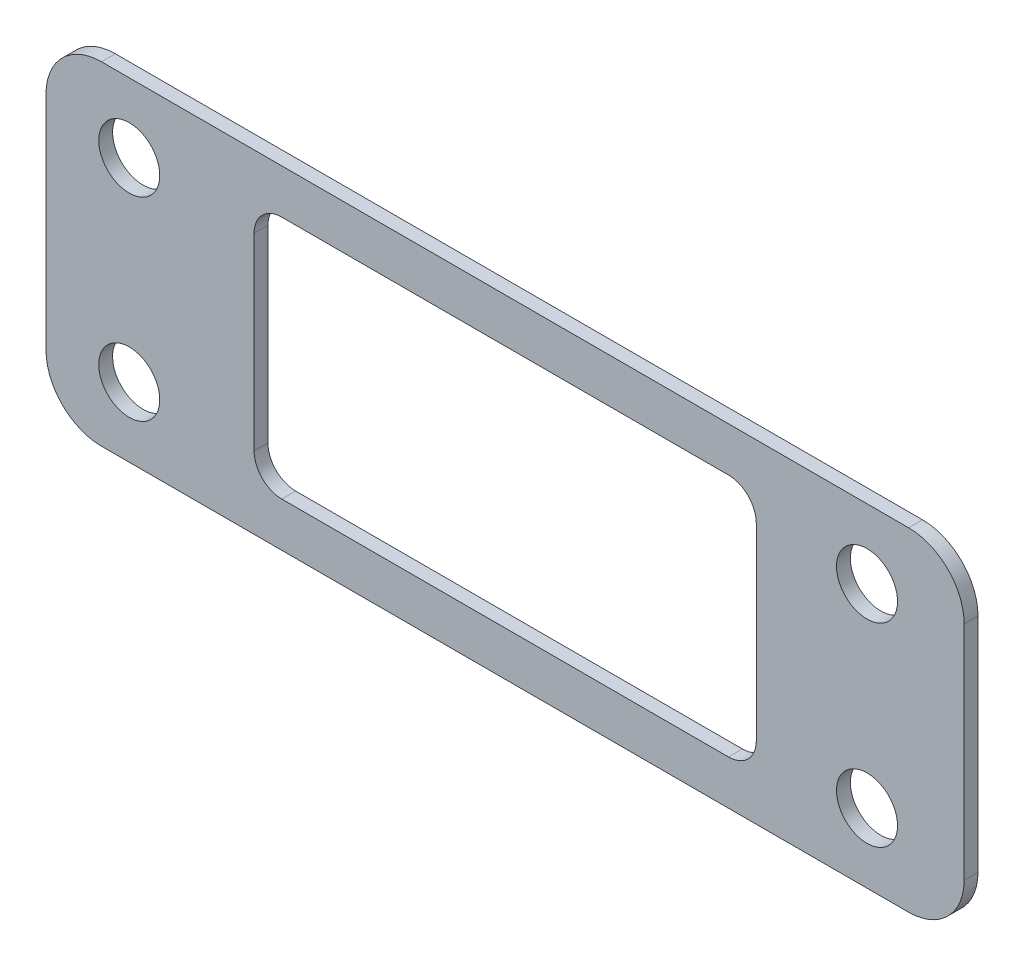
from build123d import *

# Parameters (mm, degrees)
SZKIC11_W                                    = 120
SZKIC11_H                                    = 5
BLACHA_120X5_CONFIGURED_BLACHA_120X5_1_DEPTH = 330.91883092
ZAOKR_GLENIE2_R                              = 20
SZKIC14_R                                    = 11
WYTNIJ_WYCI_GNI_CIE2_DEPTH                   = 20
SZKIC16_W                                    = 181
SZKIC16_H                                    = 88
WYTNIJ_WYCI_GNI_CIE3_DEPTH                   = 5
ZAOKR_GLENIE3_R                              = 10


with BuildPart() as part:
    # Szkic11 → Blacha 120x5 - configured BLACHA 120X5_1 (new body)
    with BuildSketch(Plane(origin=(487.975370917, 0, -1013.91695165), x_dir=(0, 1, 0), z_dir=(1, 0, 0))):
        Rectangle(SZKIC11_W, SZKIC11_H)
    extrude(amount=BLACHA_120X5_CONFIGURED_BLACHA_120X5_1_DEPTH)

    # Zaokr_glenie2
    zaokr_glenie2_edges = [part.edges().sort_by_distance(p)[0] for p in [
        (818.894201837, -60, -1013.91695165),
        (818.894201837, 60, -1013.91695165),
        (487.975370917, -60, -1013.91695165),
        (487.975370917, 60, -1013.91695165),
    ]]
    fillet(zaokr_glenie2_edges, radius=ZAOKR_GLENIE2_R)

    # Szkic14 → Wytnij-wyci_gni_cie2 (cut)
    with BuildSketch(Plane(origin=(0, 0, -1016.41695165), x_dir=(-1, 0, 0), z_dir=(0, 0, -1))):
        with Locations(Location((-783.894201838, 35, 0), (0, 0, 90))):
            Circle(SZKIC14_R)
        with Locations(Location((-783.894201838, -35, 0), (0, 0, 90))):
            Circle(SZKIC14_R)
        with Locations(Location((-517.975370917, 35, 0), (0, 0, 90))):
            Circle(SZKIC14_R)
        with Locations(Location((-517.975370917, -35, 0), (0, 0, 90))):
            Circle(SZKIC14_R)
    extrude(amount=-WYTNIJ_WYCI_GNI_CIE2_DEPTH, mode=Mode.SUBTRACT)

    # Szkic16 → Wytnij-wyci_gni_cie3 (cut)
    with BuildSketch(Plane(origin=(0, 0, -1016.41695165), x_dir=(-1, 0, 0), z_dir=(0, 0, -1))):
        with Locations((-653.475370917, 0)):
            Rectangle(SZKIC16_W, SZKIC16_H)
    extrude(amount=-WYTNIJ_WYCI_GNI_CIE3_DEPTH, mode=Mode.SUBTRACT)

    # Zaokr_glenie3
    zaokr_glenie3_edges = [part.edges().sort_by_distance(p)[0] for p in [
        (743.975370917, -44, -1013.91695165),
        (743.975370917, 44, -1013.91695165),
        (562.975370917, 44, -1013.91695165),
        (562.975370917, -44, -1013.91695165),
    ]]
    fillet(zaokr_glenie3_edges, radius=ZAOKR_GLENIE3_R)


solid = part.part
